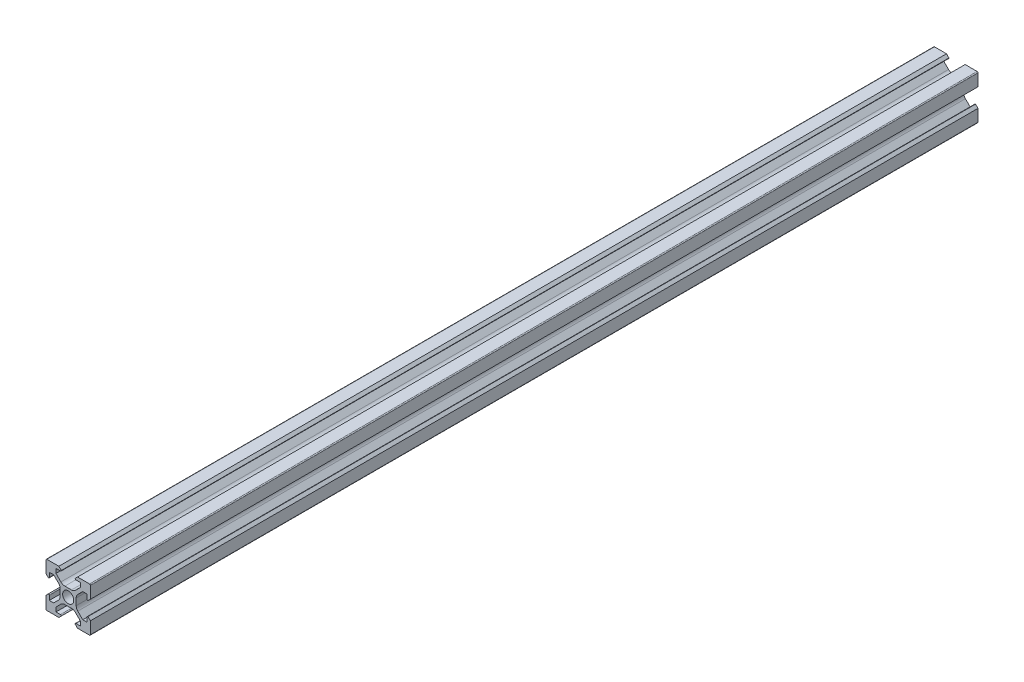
from build123d import *

# Parameters (mm, degrees)
RESSALTO_EXTRUS_O1_DEPTH = 200


with BuildPart() as part:
    # Esbo_o1 → Ressalto-extrus_o1 (new, symmetric)
    with BuildSketch(Plane.XY):
        with BuildLine():
            Line((-3.1, 8.9), (-4.2, 10))
            Line((-4.2, 10), (-9.6, 10))
            ThreePointArc((-9.6, 10), (-9.882842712, 9.882842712), (-10, 9.6))
            Line((-10, 9.6), (-10, 4.2))
            Line((-10, 4.2), (-8.9, 3.1))
            ThreePointArc((-8.9, 3.1), (-8.617157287, 3.217157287), (-8.5, 3.5))
            Line((-8.5, 3.5), (-8.5, 5.5))
            Line((-8.5, 5.5), (-6.560660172, 5.5))
            Line((-6.560660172, 5.5), (-4.332233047, 3.271572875))
            ThreePointArc((-4.332233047, 3.271572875), (-3.790301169, 2.460514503), (-3.6, 1.503805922))
            Line((-3.6, 1.503805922), (-3.6, 0))
            Line((-3.6, 0), (-3.6, -1.503805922))
            ThreePointArc((-3.6, -1.503805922), (-3.790301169, -2.460514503), (-4.332233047, -3.271572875))
            Line((-4.332233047, -3.271572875), (-6.560660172, -5.5))
            Line((-6.560660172, -5.5), (-8.5, -5.5))
            Line((-8.5, -5.5), (-8.5, -3.5))
            ThreePointArc((-8.5, -3.5), (-8.617157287, -3.217157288), (-8.9, -3.1))
            Line((-8.9, -3.1), (-10, -4.2))
            Line((-10, -4.2), (-10, -9.6))
            ThreePointArc((-10, -9.6), (-9.882842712, -9.882842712), (-9.6, -10))
            Line((-9.6, -10), (-4.2, -10))
            Line((-4.2, -10), (-3.1, -8.9))
            ThreePointArc((-3.1, -8.9), (-3.217157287, -8.617157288), (-3.5, -8.5))
            Line((-3.5, -8.5), (-5.5, -8.5))
            Line((-5.5, -8.5), (-5.5, -6.560660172))
            Line((-5.5, -6.560660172), (-3.271572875, -4.332233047))
            ThreePointArc((-3.271572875, -4.332233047), (-2.460514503, -3.790301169), (-1.503805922, -3.6))
            Line((-1.503805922, -3.6), (1.503805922, -3.6))
            ThreePointArc((1.503805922, -3.6), (2.460514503, -3.790301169), (3.271572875, -4.332233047))
            Line((3.271572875, -4.332233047), (5.5, -6.560660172))
            Line((5.5, -6.560660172), (5.5, -8.5))
            Line((5.5, -8.5), (3.5, -8.5))
            ThreePointArc((3.5, -8.5), (3.217157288, -8.617157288), (3.1, -8.9))
            Line((3.1, -8.9), (4.2, -10))
            Line((4.2, -10), (9.6, -10))
            ThreePointArc((9.6, -10), (9.882842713, -9.882842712), (10, -9.6))
            Line((10, -9.6), (10, -4.2))
            Line((10, -4.2), (8.9, -3.1))
            ThreePointArc((8.9, -3.1), (8.617157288, -3.217157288), (8.5, -3.5))
            Line((8.5, -3.5), (8.5, -5.5))
            Line((8.5, -5.5), (6.560660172, -5.5))
            Line((6.560660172, -5.5), (4.332233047, -3.271572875))
            ThreePointArc((4.332233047, -3.271572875), (3.790301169, -2.460514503), (3.6, -1.503805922))
            Line((3.6, -1.503805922), (3.6, 0))
            Line((3.6, 0), (3.6, 1.503805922))
            ThreePointArc((3.6, 1.503805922), (3.790301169, 2.460514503), (4.332233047, 3.271572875))
            Line((4.332233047, 3.271572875), (6.560660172, 5.5))
            Line((6.560660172, 5.5), (8.5, 5.5))
            Line((8.5, 5.5), (8.5, 3.5))
            ThreePointArc((8.5, 3.5), (8.617157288, 3.217157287), (8.9, 3.1))
            Line((8.9, 3.1), (10, 4.2))
            Line((10, 4.2), (10, 9.6))
            ThreePointArc((10, 9.6), (9.882842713, 9.882842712), (9.6, 10))
            Line((9.6, 10), (4.2, 10))
            Line((4.2, 10), (3.1, 8.9))
            ThreePointArc((3.1, 8.9), (3.217157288, 8.617157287), (3.5, 8.5))
            Line((3.5, 8.5), (5.5, 8.5))
            Line((5.5, 8.5), (5.5, 6.560660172))
            Line((5.5, 6.560660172), (3.271572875, 4.332233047))
            ThreePointArc((3.271572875, 4.332233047), (2.460514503, 3.790301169), (1.503805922, 3.6))
            Line((1.503805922, 3.6), (-1.503805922, 3.6))
            ThreePointArc((-1.503805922, 3.6), (-2.460514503, 3.790301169), (-3.271572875, 4.332233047))
            Line((-3.271572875, 4.332233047), (-5.5, 6.560660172))
            Line((-5.5, 6.560660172), (-5.5, 8.5))
            Line((-5.5, 8.5), (-3.5, 8.5))
            ThreePointArc((-3.5, 8.5), (-3.217157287, 8.617157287), (-3.1, 8.9))
        make_face()
        with BuildLine():
            ThreePointArc((2.5, 0), (0, 2.5), (-2.5, 0))
            ThreePointArc((-2.5, 0), (0, -2.5), (2.5, 0))
        make_face(mode=Mode.SUBTRACT)
    extrude(amount=RESSALTO_EXTRUS_O1_DEPTH, both=True)


solid = part.part
